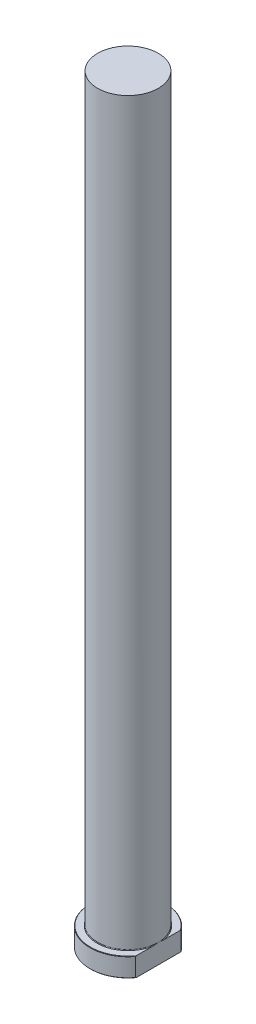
from build123d import *
from build123d.topology import SkipClean

# Parameters (mm, degrees)
CHAMFER1_SIZE = 0.2
FILLET1_R     = 0.3
KEY_DEPTH     = 401.998753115


with BuildPart() as part:
    # Sketch1 → Revolve1 (revolve)
    with BuildSketch(Plane.XY, mode=Mode.PRIVATE) as revolve1_sk:
        Polygon((0, 0), (-20, 0), (-20, 10), (-16, 10), (-16, 400), (0, 400), align=None)
    revolve(revolve1_sk.sketch.rotate(Axis((0, 259.958771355, 0), (0, -1, 0)), 270), axis=Axis((0, 259.958771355, 0), (0, -1, 0)))

    # Chamfer1
    chamfer1_edges = [part.edges().sort_by_distance(p)[0] for p in [
        (0, 10, -20),
        (0, 0, -20),
    ]]
    chamfer(chamfer1_edges, length=CHAMFER1_SIZE)

    # Fillet1
    fillet1_edges = [part.edges().sort_by_distance(p)[0] for p in [
        (0, 10, -16),
    ]]
    fillet(fillet1_edges, radius=FILLET1_R)

    # Sketch2 → KEY (cut, through all)
    with SkipClean():  # the faces are left unmerged after this step: merging them gives an invalid solid
        with BuildSketch(Plane(origin=(0, 0, 0), x_dir=(1, 0, 0), z_dir=(0, 1, 0))):
            with BuildLine():
                Line((16, 12), (16, -12))
                ThreePointArc((16, -12), (20, 0), (16, 12))
            make_face()
        extrude(amount=KEY_DEPTH, mode=Mode.SUBTRACT)


solid = part.part
